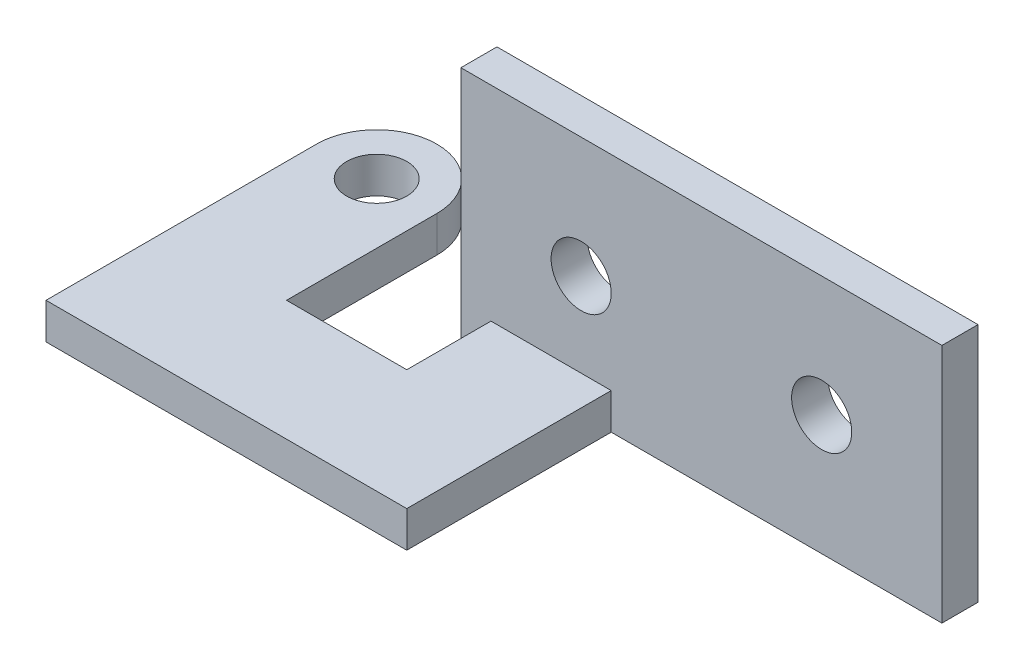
ISO-10303-21;
HEADER;
FILE_DESCRIPTION(('STEP AP214'),'2;1');
FILE_NAME('part.step','',(''),(''),'','','');
FILE_SCHEMA(('AUTOMOTIVE_DESIGN { 1 0 10303 214 1 1 1 1 }'));
ENDSEC;
DATA;
#1=APPLICATION_CONTEXT('core data for automotive mechanical design processes');
#2=APPLICATION_PROTOCOL_DEFINITION('international standard','automotive_design',2000,#1);
#3=PRODUCT_CONTEXT('',#1,'mechanical');
#4=PRODUCT('Part','Part','',(#3));
#5=PRODUCT_RELATED_PRODUCT_CATEGORY('part','',(#4));
#6=PRODUCT_DEFINITION_FORMATION('','',#4);
#7=PRODUCT_DEFINITION_CONTEXT('part definition',#1,'design');
#8=PRODUCT_DEFINITION('design','',#6,#7);
#9=PRODUCT_DEFINITION_SHAPE('','',#8);
#10=(LENGTH_UNIT() NAMED_UNIT(*) SI_UNIT(.MILLI.,.METRE.));
#11=(NAMED_UNIT(*) PLANE_ANGLE_UNIT() SI_UNIT($,.RADIAN.));
#12=(NAMED_UNIT(*) SI_UNIT($,.STERADIAN.) SOLID_ANGLE_UNIT());
#13=UNCERTAINTY_MEASURE_WITH_UNIT(LENGTH_MEASURE(1.E-05),#10,'distance_accuracy_value','');
#14=(GEOMETRIC_REPRESENTATION_CONTEXT(3) GLOBAL_UNCERTAINTY_ASSIGNED_CONTEXT((#13)) GLOBAL_UNIT_ASSIGNED_CONTEXT((#10,
#11,#12)) REPRESENTATION_CONTEXT('',''));
#15=CARTESIAN_POINT('',(0.,0.,0.));
#16=DIRECTION('',(0.,0.,1.));
#17=DIRECTION('',(1.,0.,0.));
#18=AXIS2_PLACEMENT_3D('',#15,#16,#17);
#19=CARTESIAN_POINT('',(0.,20.,3.));
#20=DIRECTION('',(0.,0.,-1.));
#21=DIRECTION('',(-1.,0.,0.));
#22=AXIS2_PLACEMENT_3D('',#19,#20,#21);
#23=PLANE('',#22);
#24=CARTESIAN_POINT('',(10.,10.,3.));
#25=DIRECTION('',(0.,0.,1.));
#26=DIRECTION('',(1.,0.,0.));
#27=AXIS2_PLACEMENT_3D('',#24,#25,#26);
#28=CIRCLE('',#27,2.5);
#29=CARTESIAN_POINT('',(12.5,10.,3.));
#30=VERTEX_POINT('',#29);
#31=EDGE_CURVE('E193',#30,#30,#28,.T.);
#32=ORIENTED_EDGE('',*,*,#31,.F.);
#33=EDGE_LOOP('',(#32));
#34=FACE_BOUND('',#33,.T.);
#35=DIRECTION('',(1.,0.,0.));
#36=VECTOR('',#35,1.);
#37=CARTESIAN_POINT('',(0.,3.,3.));
#38=LINE('',#37,#36);
#39=CARTESIAN_POINT('',(2.5000000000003,3.,3.));
#40=VERTEX_POINT('',#39);
#41=CARTESIAN_POINT('',(12.5000000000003,3.,3.));
#42=VERTEX_POINT('',#41);
#43=EDGE_CURVE('E184',#40,#42,#38,.T.);
#44=ORIENTED_EDGE('',*,*,#43,.T.);
#45=DIRECTION('',(0.,-1.,0.));
#46=VECTOR('',#45,1.);
#47=CARTESIAN_POINT('',(12.5000000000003,20.,3.));
#48=LINE('',#47,#46);
#49=CARTESIAN_POINT('',(12.5000000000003,0.,3.));
#50=VERTEX_POINT('',#49);
#51=EDGE_CURVE('E181',#42,#50,#48,.T.);
#52=ORIENTED_EDGE('',*,*,#51,.T.);
#53=DIRECTION('',(1.,0.,0.));
#54=VECTOR('',#53,1.);
#55=CARTESIAN_POINT('',(0.,0.,3.));
#56=LINE('',#55,#54);
#57=CARTESIAN_POINT('',(40.,0.,3.));
#58=VERTEX_POINT('',#57);
#59=EDGE_CURVE('E202',#50,#58,#56,.T.);
#60=ORIENTED_EDGE('',*,*,#59,.T.);
#61=DIRECTION('',(0.,1.,0.));
#62=VECTOR('',#61,1.);
#63=CARTESIAN_POINT('',(40.,0.,3.));
#64=LINE('',#63,#62);
#65=CARTESIAN_POINT('',(40.,20.,3.));
#66=VERTEX_POINT('',#65);
#67=EDGE_CURVE('E206',#58,#66,#64,.T.);
#68=ORIENTED_EDGE('',*,*,#67,.T.);
#69=DIRECTION('',(-1.,0.,0.));
#70=VECTOR('',#69,1.);
#71=CARTESIAN_POINT('',(0.,20.,3.));
#72=LINE('',#71,#70);
#73=CARTESIAN_POINT('',(0.,20.,3.));
#74=VERTEX_POINT('',#73);
#75=EDGE_CURVE('E208',#66,#74,#72,.T.);
#76=ORIENTED_EDGE('',*,*,#75,.T.);
#77=DIRECTION('',(0.,-1.,0.));
#78=VECTOR('',#77,1.);
#79=CARTESIAN_POINT('',(0.,0.,3.));
#80=LINE('',#79,#78);
#81=CARTESIAN_POINT('',(0.,0.,3.));
#82=VERTEX_POINT('',#81);
#83=EDGE_CURVE('E199',#74,#82,#80,.T.);
#84=ORIENTED_EDGE('',*,*,#83,.T.);
#85=CARTESIAN_POINT('',(2.5000000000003,0.,3.));
#86=VERTEX_POINT('',#85);
#87=EDGE_CURVE('E204',#82,#86,#56,.T.);
#88=ORIENTED_EDGE('',*,*,#87,.T.);
#89=DIRECTION('',(0.,1.,0.));
#90=VECTOR('',#89,1.);
#91=CARTESIAN_POINT('',(2.5000000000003,20.,3.));
#92=LINE('',#91,#90);
#93=EDGE_CURVE('E175',#86,#40,#92,.T.);
#94=ORIENTED_EDGE('',*,*,#93,.T.);
#95=EDGE_LOOP('',(#44,#52,#60,#68,#76,#84,#88,#94));
#96=FACE_BOUND('',#95,.T.);
#97=CARTESIAN_POINT('',(30.,10.,3.));
#98=DIRECTION('',(0.,0.,1.));
#99=DIRECTION('',(1.,0.,0.));
#100=AXIS2_PLACEMENT_3D('',#97,#98,#99);
#101=CIRCLE('',#100,2.5);
#102=CARTESIAN_POINT('',(32.5,10.,3.));
#103=VERTEX_POINT('',#102);
#104=EDGE_CURVE('E187',#103,#103,#101,.T.);
#105=ORIENTED_EDGE('',*,*,#104,.F.);
#106=EDGE_LOOP('',(#105));
#107=FACE_BOUND('',#106,.T.);
#108=ADVANCED_FACE('F31',(#34,#96,#107),#23,.F.);
#109=CARTESIAN_POINT('',(0.,20.,0.));
#110=DIRECTION('',(0.,0.,-1.));
#111=DIRECTION('',(-1.,0.,0.));
#112=AXIS2_PLACEMENT_3D('',#109,#110,#111);
#113=PLANE('',#112);
#114=DIRECTION('',(0.,1.,0.));
#115=VECTOR('',#114,1.);
#116=CARTESIAN_POINT('',(40.,0.,0.));
#117=LINE('',#116,#115);
#118=CARTESIAN_POINT('',(40.,0.,0.));
#119=VERTEX_POINT('',#118);
#120=CARTESIAN_POINT('',(40.,20.,0.));
#121=VERTEX_POINT('',#120);
#122=EDGE_CURVE('E215',#119,#121,#117,.T.);
#123=ORIENTED_EDGE('',*,*,#122,.F.);
#124=DIRECTION('',(1.,0.,0.));
#125=VECTOR('',#124,1.);
#126=CARTESIAN_POINT('',(0.,0.,0.));
#127=LINE('',#126,#125);
#128=CARTESIAN_POINT('',(0.,0.,0.));
#129=VERTEX_POINT('',#128);
#130=EDGE_CURVE('E213',#129,#119,#127,.T.);
#131=ORIENTED_EDGE('',*,*,#130,.F.);
#132=DIRECTION('',(0.,-1.,0.));
#133=VECTOR('',#132,1.);
#134=CARTESIAN_POINT('',(0.,0.,0.));
#135=LINE('',#134,#133);
#136=CARTESIAN_POINT('',(0.,20.,0.));
#137=VERTEX_POINT('',#136);
#138=EDGE_CURVE('E196',#137,#129,#135,.T.);
#139=ORIENTED_EDGE('',*,*,#138,.F.);
#140=DIRECTION('',(-1.,0.,0.));
#141=VECTOR('',#140,1.);
#142=CARTESIAN_POINT('',(0.,20.,0.));
#143=LINE('',#142,#141);
#144=EDGE_CURVE('E203',#121,#137,#143,.T.);
#145=ORIENTED_EDGE('',*,*,#144,.F.);
#146=EDGE_LOOP('',(#123,#131,#139,#145));
#147=FACE_BOUND('',#146,.T.);
#148=CARTESIAN_POINT('',(10.,10.,0.));
#149=DIRECTION('',(0.,0.,1.));
#150=DIRECTION('',(1.,0.,0.));
#151=AXIS2_PLACEMENT_3D('',#148,#149,#150);
#152=CIRCLE('',#151,2.5);
#153=CARTESIAN_POINT('',(12.5,10.,0.));
#154=VERTEX_POINT('',#153);
#155=EDGE_CURVE('E190',#154,#154,#152,.T.);
#156=ORIENTED_EDGE('',*,*,#155,.T.);
#157=EDGE_LOOP('',(#156));
#158=FACE_BOUND('',#157,.T.);
#159=CARTESIAN_POINT('',(30.,10.,0.));
#160=DIRECTION('',(0.,0.,1.));
#161=DIRECTION('',(1.,0.,0.));
#162=AXIS2_PLACEMENT_3D('',#159,#160,#161);
#163=CIRCLE('',#162,2.5);
#164=CARTESIAN_POINT('',(32.5,10.,0.));
#165=VERTEX_POINT('',#164);
#166=EDGE_CURVE('E186',#165,#165,#163,.T.);
#167=ORIENTED_EDGE('',*,*,#166,.T.);
#168=EDGE_LOOP('',(#167));
#169=FACE_BOUND('',#168,.T.);
#170=ADVANCED_FACE('F265',(#147,#158,#169),#113,.T.);
#171=CARTESIAN_POINT('',(0.,0.,3.));
#172=DIRECTION('',(1.,0.,0.));
#173=DIRECTION('',(0.,0.,-1.));
#174=AXIS2_PLACEMENT_3D('',#171,#172,#173);
#175=PLANE('',#174);
#176=ORIENTED_EDGE('',*,*,#138,.T.);
#177=DIRECTION('',(0.,0.,-1.));
#178=VECTOR('',#177,1.);
#179=CARTESIAN_POINT('',(0.,0.,3.));
#180=LINE('',#179,#178);
#181=EDGE_CURVE('E226',#82,#129,#180,.T.);
#182=ORIENTED_EDGE('',*,*,#181,.F.);
#183=ORIENTED_EDGE('',*,*,#83,.F.);
#184=DIRECTION('',(0.,0.,-1.));
#185=VECTOR('',#184,1.);
#186=CARTESIAN_POINT('',(0.,20.,3.));
#187=LINE('',#186,#185);
#188=EDGE_CURVE('E210',#74,#137,#187,.T.);
#189=ORIENTED_EDGE('',*,*,#188,.T.);
#190=EDGE_LOOP('',(#176,#182,#183,#189));
#191=FACE_BOUND('',#190,.T.);
#192=ADVANCED_FACE('F272',(#191),#175,.F.);
#193=CARTESIAN_POINT('',(0.,0.,3.));
#194=DIRECTION('',(0.,1.,0.));
#195=DIRECTION('',(0.,0.,1.));
#196=AXIS2_PLACEMENT_3D('',#193,#194,#195);
#197=PLANE('',#196);
#198=CARTESIAN_POINT('',(-12.4999999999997,0.,-2.5));
#199=DIRECTION('',(0.,1.,0.));
#200=DIRECTION('',(0.,0.,1.));
#201=AXIS2_PLACEMENT_3D('',#198,#199,#200);
#202=CIRCLE('',#201,5.);
#203=CARTESIAN_POINT('',(-17.4999999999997,0.,-2.5));
#204=VERTEX_POINT('',#203);
#205=CARTESIAN_POINT('',(-12.4999999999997,0.,-7.5));
#206=VERTEX_POINT('',#205);
#207=EDGE_CURVE('E229',#204,#206,#202,.F.);
#208=ORIENTED_EDGE('',*,*,#207,.T.);
#209=CARTESIAN_POINT('',(-12.4999999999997,0.,-2.5));
#210=DIRECTION('',(0.,1.,0.));
#211=DIRECTION('',(0.,0.,1.));
#212=AXIS2_PLACEMENT_3D('',#209,#210,#211);
#213=CIRCLE('',#212,5.);
#214=CARTESIAN_POINT('',(-7.4999999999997,0.,-2.5));
#215=VERTEX_POINT('',#214);
#216=EDGE_CURVE('E231',#206,#215,#213,.F.);
#217=ORIENTED_EDGE('',*,*,#216,.T.);
#218=DIRECTION('',(0.,0.,1.));
#219=VECTOR('',#218,1.);
#220=CARTESIAN_POINT('',(-7.49999999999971,0.,10.));
#221=LINE('',#220,#219);
#222=CARTESIAN_POINT('',(-7.49999999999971,0.,10.));
#223=VERTEX_POINT('',#222);
#224=EDGE_CURVE('E159',#215,#223,#221,.T.);
#225=ORIENTED_EDGE('',*,*,#224,.T.);
#226=DIRECTION('',(1.,0.,0.));
#227=VECTOR('',#226,1.);
#228=CARTESIAN_POINT('',(2.5000000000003,0.,10.));
#229=LINE('',#228,#227);
#230=CARTESIAN_POINT('',(2.5000000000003,0.,10.));
#231=VERTEX_POINT('',#230);
#232=EDGE_CURVE('E140',#223,#231,#229,.T.);
#233=ORIENTED_EDGE('',*,*,#232,.T.);
#234=DIRECTION('',(0.,0.,-1.));
#235=VECTOR('',#234,1.);
#236=CARTESIAN_POINT('',(2.5000000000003,0.,0.));
#237=LINE('',#236,#235);
#238=EDGE_CURVE('E163',#231,#86,#237,.T.);
#239=ORIENTED_EDGE('',*,*,#238,.T.);
#240=ORIENTED_EDGE('',*,*,#87,.F.);
#241=ORIENTED_EDGE('',*,*,#181,.T.);
#242=ORIENTED_EDGE('',*,*,#130,.T.);
#243=DIRECTION('',(0.,0.,-1.));
#244=VECTOR('',#243,1.);
#245=CARTESIAN_POINT('',(40.,0.,3.));
#246=LINE('',#245,#244);
#247=EDGE_CURVE('E223',#58,#119,#246,.T.);
#248=ORIENTED_EDGE('',*,*,#247,.F.);
#249=ORIENTED_EDGE('',*,*,#59,.F.);
#250=DIRECTION('',(0.,0.,1.));
#251=VECTOR('',#250,1.);
#252=CARTESIAN_POINT('',(12.5000000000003,0.,20.));
#253=LINE('',#252,#251);
#254=CARTESIAN_POINT('',(12.5000000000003,0.,20.));
#255=VERTEX_POINT('',#254);
#256=EDGE_CURVE('E166',#50,#255,#253,.T.);
#257=ORIENTED_EDGE('',*,*,#256,.T.);
#258=DIRECTION('',(-1.,0.,0.));
#259=VECTOR('',#258,1.);
#260=CARTESIAN_POINT('',(-17.4999999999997,0.,20.));
#261=LINE('',#260,#259);
#262=CARTESIAN_POINT('',(-17.4999999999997,0.,20.));
#263=VERTEX_POINT('',#262);
#264=EDGE_CURVE('E168',#255,#263,#261,.T.);
#265=ORIENTED_EDGE('',*,*,#264,.T.);
#266=DIRECTION('',(0.,0.,-1.));
#267=VECTOR('',#266,1.);
#268=CARTESIAN_POINT('',(-17.4999999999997,0.,-7.5));
#269=LINE('',#268,#267);
#270=EDGE_CURVE('E134',#263,#204,#269,.T.);
#271=ORIENTED_EDGE('',*,*,#270,.T.);
#272=EDGE_LOOP('',(#208,#217,#225,#233,#239,#240,#241,#242,#248,#249,#257,#265,#271));
#273=FACE_BOUND('',#272,.T.);
#274=CARTESIAN_POINT('',(-12.4999999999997,0.,-2.5));
#275=DIRECTION('',(0.,-1.,0.));
#276=DIRECTION('',(0.,0.,-1.));
#277=AXIS2_PLACEMENT_3D('',#274,#275,#276);
#278=CIRCLE('',#277,2.5);
#279=CARTESIAN_POINT('',(-12.4999999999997,0.,-5.));
#280=VERTEX_POINT('',#279);
#281=EDGE_CURVE('E245',#280,#280,#278,.T.);
#282=ORIENTED_EDGE('',*,*,#281,.F.);
#283=EDGE_LOOP('',(#282));
#284=FACE_BOUND('',#283,.T.);
#285=ADVANCED_FACE('F237',(#273,#284),#197,.F.);
#286=CARTESIAN_POINT('',(40.,0.,3.));
#287=DIRECTION('',(-1.,0.,0.));
#288=DIRECTION('',(0.,0.,1.));
#289=AXIS2_PLACEMENT_3D('',#286,#287,#288);
#290=PLANE('',#289);
#291=ORIENTED_EDGE('',*,*,#122,.T.);
#292=DIRECTION('',(0.,0.,-1.));
#293=VECTOR('',#292,1.);
#294=CARTESIAN_POINT('',(40.,20.,3.));
#295=LINE('',#294,#293);
#296=EDGE_CURVE('E220',#66,#121,#295,.T.);
#297=ORIENTED_EDGE('',*,*,#296,.F.);
#298=ORIENTED_EDGE('',*,*,#67,.F.);
#299=ORIENTED_EDGE('',*,*,#247,.T.);
#300=EDGE_LOOP('',(#291,#297,#298,#299));
#301=FACE_BOUND('',#300,.T.);
#302=ADVANCED_FACE('F284',(#301),#290,.F.);
#303=CARTESIAN_POINT('',(0.,20.,3.));
#304=DIRECTION('',(0.,-1.,0.));
#305=DIRECTION('',(0.,0.,-1.));
#306=AXIS2_PLACEMENT_3D('',#303,#304,#305);
#307=PLANE('',#306);
#308=ORIENTED_EDGE('',*,*,#144,.T.);
#309=ORIENTED_EDGE('',*,*,#188,.F.);
#310=ORIENTED_EDGE('',*,*,#75,.F.);
#311=ORIENTED_EDGE('',*,*,#296,.T.);
#312=EDGE_LOOP('',(#308,#309,#310,#311));
#313=FACE_BOUND('',#312,.T.);
#314=ADVANCED_FACE('F281',(#313),#307,.F.);
#315=CARTESIAN_POINT('',(10.,10.,3.));
#316=DIRECTION('',(0.,0.,-1.));
#317=DIRECTION('',(-1.,0.,0.));
#318=AXIS2_PLACEMENT_3D('',#315,#316,#317);
#319=CYLINDRICAL_SURFACE('',#318,2.5);
#320=ORIENTED_EDGE('',*,*,#31,.T.);
#321=EDGE_LOOP('',(#320));
#322=FACE_BOUND('',#321,.T.);
#323=ORIENTED_EDGE('',*,*,#155,.F.);
#324=EDGE_LOOP('',(#323));
#325=FACE_BOUND('',#324,.T.);
#326=ADVANCED_FACE('F278',(#322,#325),#319,.F.);
#327=CARTESIAN_POINT('',(30.,10.,3.));
#328=DIRECTION('',(0.,0.,-1.));
#329=DIRECTION('',(-1.,0.,0.));
#330=AXIS2_PLACEMENT_3D('',#327,#328,#329);
#331=CYLINDRICAL_SURFACE('',#330,2.5);
#332=ORIENTED_EDGE('',*,*,#104,.T.);
#333=EDGE_LOOP('',(#332));
#334=FACE_BOUND('',#333,.T.);
#335=ORIENTED_EDGE('',*,*,#166,.F.);
#336=EDGE_LOOP('',(#335));
#337=FACE_BOUND('',#336,.T.);
#338=ADVANCED_FACE('F334',(#334,#337),#331,.F.);
#339=CARTESIAN_POINT('',(-7.4999999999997,3.,-7.5));
#340=DIRECTION('',(0.,1.,0.));
#341=DIRECTION('',(0.,0.,1.));
#342=AXIS2_PLACEMENT_3D('',#339,#340,#341);
#343=PLANE('',#342);
#344=CARTESIAN_POINT('',(-12.4999999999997,3.,-2.5));
#345=DIRECTION('',(0.,-1.,0.));
#346=DIRECTION('',(0.,0.,-1.));
#347=AXIS2_PLACEMENT_3D('',#344,#345,#346);
#348=CIRCLE('',#347,2.5);
#349=CARTESIAN_POINT('',(-12.4999999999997,3.,-5.));
#350=VERTEX_POINT('',#349);
#351=EDGE_CURVE('E161',#350,#350,#348,.T.);
#352=ORIENTED_EDGE('',*,*,#351,.T.);
#353=EDGE_LOOP('',(#352));
#354=FACE_BOUND('',#353,.T.);
#355=DIRECTION('',(0.,0.,1.));
#356=VECTOR('',#355,1.);
#357=CARTESIAN_POINT('',(-7.49999999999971,3.,10.));
#358=LINE('',#357,#356);
#359=CARTESIAN_POINT('',(-7.4999999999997,3.,-2.5));
#360=VERTEX_POINT('',#359);
#361=CARTESIAN_POINT('',(-7.49999999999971,3.,10.));
#362=VERTEX_POINT('',#361);
#363=EDGE_CURVE('E124',#360,#362,#358,.T.);
#364=ORIENTED_EDGE('',*,*,#363,.F.);
#365=CARTESIAN_POINT('',(-12.4999999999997,3.,-2.5));
#366=DIRECTION('',(0.,1.,0.));
#367=DIRECTION('',(0.,0.,1.));
#368=AXIS2_PLACEMENT_3D('',#365,#366,#367);
#369=CIRCLE('',#368,5.);
#370=CARTESIAN_POINT('',(-12.4999999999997,3.,-7.5));
#371=VERTEX_POINT('',#370);
#372=EDGE_CURVE('E40',#360,#371,#369,.T.);
#373=ORIENTED_EDGE('',*,*,#372,.T.);
#374=CARTESIAN_POINT('',(-12.4999999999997,3.,-2.5));
#375=DIRECTION('',(0.,1.,0.));
#376=DIRECTION('',(0.,0.,1.));
#377=AXIS2_PLACEMENT_3D('',#374,#375,#376);
#378=CIRCLE('',#377,5.);
#379=CARTESIAN_POINT('',(-17.4999999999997,3.,-2.5));
#380=VERTEX_POINT('',#379);
#381=EDGE_CURVE('E47',#371,#380,#378,.T.);
#382=ORIENTED_EDGE('',*,*,#381,.T.);
#383=DIRECTION('',(0.,0.,-1.));
#384=VECTOR('',#383,1.);
#385=CARTESIAN_POINT('',(-17.4999999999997,3.,-7.5));
#386=LINE('',#385,#384);
#387=CARTESIAN_POINT('',(-17.4999999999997,3.,20.));
#388=VERTEX_POINT('',#387);
#389=EDGE_CURVE('E142',#388,#380,#386,.T.);
#390=ORIENTED_EDGE('',*,*,#389,.F.);
#391=DIRECTION('',(-1.,0.,0.));
#392=VECTOR('',#391,1.);
#393=CARTESIAN_POINT('',(-17.4999999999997,3.,20.));
#394=LINE('',#393,#392);
#395=CARTESIAN_POINT('',(12.5000000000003,3.,20.));
#396=VERTEX_POINT('',#395);
#397=EDGE_CURVE('E155',#396,#388,#394,.T.);
#398=ORIENTED_EDGE('',*,*,#397,.F.);
#399=DIRECTION('',(0.,0.,1.));
#400=VECTOR('',#399,1.);
#401=CARTESIAN_POINT('',(12.5000000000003,3.,20.));
#402=LINE('',#401,#400);
#403=EDGE_CURVE('E150',#42,#396,#402,.T.);
#404=ORIENTED_EDGE('',*,*,#403,.F.);
#405=ORIENTED_EDGE('',*,*,#43,.F.);
#406=DIRECTION('',(0.,0.,-1.));
#407=VECTOR('',#406,1.);
#408=CARTESIAN_POINT('',(2.5000000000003,3.,0.));
#409=LINE('',#408,#407);
#410=CARTESIAN_POINT('',(2.5000000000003,3.,10.));
#411=VERTEX_POINT('',#410);
#412=EDGE_CURVE('E148',#411,#40,#409,.T.);
#413=ORIENTED_EDGE('',*,*,#412,.F.);
#414=DIRECTION('',(1.,0.,0.));
#415=VECTOR('',#414,1.);
#416=CARTESIAN_POINT('',(2.5000000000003,3.,10.));
#417=LINE('',#416,#415);
#418=EDGE_CURVE('E133',#362,#411,#417,.T.);
#419=ORIENTED_EDGE('',*,*,#418,.F.);
#420=EDGE_LOOP('',(#364,#373,#382,#390,#398,#404,#405,#413,#419));
#421=FACE_BOUND('',#420,.T.);
#422=ADVANCED_FACE('F145',(#354,#421),#343,.T.);
#423=CARTESIAN_POINT('',(12.5000000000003,3.,20.));
#424=DIRECTION('',(1.,0.,0.));
#425=DIRECTION('',(0.,0.,-1.));
#426=AXIS2_PLACEMENT_3D('',#423,#424,#425);
#427=PLANE('',#426);
#428=ORIENTED_EDGE('',*,*,#51,.F.);
#429=ORIENTED_EDGE('',*,*,#403,.T.);
#430=DIRECTION('',(0.,-1.,0.));
#431=VECTOR('',#430,1.);
#432=CARTESIAN_POINT('',(12.5000000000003,3.,20.));
#433=LINE('',#432,#431);
#434=EDGE_CURVE('E176',#396,#255,#433,.T.);
#435=ORIENTED_EDGE('',*,*,#434,.T.);
#436=ORIENTED_EDGE('',*,*,#256,.F.);
#437=EDGE_LOOP('',(#428,#429,#435,#436));
#438=FACE_BOUND('',#437,.T.);
#439=ADVANCED_FACE('F333',(#438),#427,.T.);
#440=CARTESIAN_POINT('',(2.5000000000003,3.,0.));
#441=DIRECTION('',(-1.,0.,0.));
#442=DIRECTION('',(0.,0.,1.));
#443=AXIS2_PLACEMENT_3D('',#440,#441,#442);
#444=PLANE('',#443);
#445=ORIENTED_EDGE('',*,*,#93,.F.);
#446=ORIENTED_EDGE('',*,*,#238,.F.);
#447=DIRECTION('',(0.,-1.,0.));
#448=VECTOR('',#447,1.);
#449=CARTESIAN_POINT('',(2.5000000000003,3.,10.));
#450=LINE('',#449,#448);
#451=EDGE_CURVE('E141',#411,#231,#450,.T.);
#452=ORIENTED_EDGE('',*,*,#451,.F.);
#453=ORIENTED_EDGE('',*,*,#412,.T.);
#454=EDGE_LOOP('',(#445,#446,#452,#453));
#455=FACE_BOUND('',#454,.T.);
#456=ADVANCED_FACE('F322',(#455),#444,.T.);
#457=CARTESIAN_POINT('',(-7.49999999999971,3.,10.));
#458=DIRECTION('',(1.,0.,0.));
#459=DIRECTION('',(0.,0.,-1.));
#460=AXIS2_PLACEMENT_3D('',#457,#458,#459);
#461=PLANE('',#460);
#462=ORIENTED_EDGE('',*,*,#224,.F.);
#463=DIRECTION('',(0.,-1.,0.));
#464=VECTOR('',#463,1.);
#465=CARTESIAN_POINT('',(-7.4999999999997,3.,-2.5));
#466=LINE('',#465,#464);
#467=EDGE_CURVE('E131',#215,#360,#466,.F.);
#468=ORIENTED_EDGE('',*,*,#467,.T.);
#469=ORIENTED_EDGE('',*,*,#363,.T.);
#470=DIRECTION('',(0.,-1.,0.));
#471=VECTOR('',#470,1.);
#472=CARTESIAN_POINT('',(-7.49999999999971,3.,10.));
#473=LINE('',#472,#471);
#474=EDGE_CURVE('E128',#362,#223,#473,.T.);
#475=ORIENTED_EDGE('',*,*,#474,.T.);
#476=EDGE_LOOP('',(#462,#468,#469,#475));
#477=FACE_BOUND('',#476,.T.);
#478=ADVANCED_FACE('F127',(#477),#461,.T.);
#479=CARTESIAN_POINT('',(-17.4999999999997,3.,-7.5));
#480=DIRECTION('',(-1.,0.,0.));
#481=DIRECTION('',(0.,0.,1.));
#482=AXIS2_PLACEMENT_3D('',#479,#480,#481);
#483=PLANE('',#482);
#484=ORIENTED_EDGE('',*,*,#389,.T.);
#485=DIRECTION('',(0.,-1.,0.));
#486=VECTOR('',#485,1.);
#487=CARTESIAN_POINT('',(-17.4999999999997,3.,-2.5));
#488=LINE('',#487,#486);
#489=EDGE_CURVE('E11',#380,#204,#488,.T.);
#490=ORIENTED_EDGE('',*,*,#489,.T.);
#491=ORIENTED_EDGE('',*,*,#270,.F.);
#492=DIRECTION('',(0.,-1.,0.));
#493=VECTOR('',#492,1.);
#494=CARTESIAN_POINT('',(-17.4999999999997,3.,20.));
#495=LINE('',#494,#493);
#496=EDGE_CURVE('E173',#388,#263,#495,.T.);
#497=ORIENTED_EDGE('',*,*,#496,.F.);
#498=EDGE_LOOP('',(#484,#490,#491,#497));
#499=FACE_BOUND('',#498,.T.);
#500=ADVANCED_FACE('F306',(#499),#483,.T.);
#501=CARTESIAN_POINT('',(-17.4999999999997,3.,20.));
#502=DIRECTION('',(0.,0.,1.));
#503=DIRECTION('',(1.,0.,0.));
#504=AXIS2_PLACEMENT_3D('',#501,#502,#503);
#505=PLANE('',#504);
#506=ORIENTED_EDGE('',*,*,#264,.F.);
#507=ORIENTED_EDGE('',*,*,#434,.F.);
#508=ORIENTED_EDGE('',*,*,#397,.T.);
#509=ORIENTED_EDGE('',*,*,#496,.T.);
#510=EDGE_LOOP('',(#506,#507,#508,#509));
#511=FACE_BOUND('',#510,.T.);
#512=ADVANCED_FACE('F261',(#511),#505,.T.);
#513=CARTESIAN_POINT('',(2.5000000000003,3.,10.));
#514=DIRECTION('',(0.,0.,-1.));
#515=DIRECTION('',(-1.,0.,0.));
#516=AXIS2_PLACEMENT_3D('',#513,#514,#515);
#517=PLANE('',#516);
#518=ORIENTED_EDGE('',*,*,#232,.F.);
#519=ORIENTED_EDGE('',*,*,#474,.F.);
#520=ORIENTED_EDGE('',*,*,#418,.T.);
#521=ORIENTED_EDGE('',*,*,#451,.T.);
#522=EDGE_LOOP('',(#518,#519,#520,#521));
#523=FACE_BOUND('',#522,.T.);
#524=ADVANCED_FACE('F138',(#523),#517,.T.);
#525=CARTESIAN_POINT('',(-12.4999999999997,3.,-2.5));
#526=DIRECTION('',(0.,-1.,0.));
#527=DIRECTION('',(0.,0.,-1.));
#528=AXIS2_PLACEMENT_3D('',#525,#526,#527);
#529=CYLINDRICAL_SURFACE('',#528,2.5);
#530=ORIENTED_EDGE('',*,*,#351,.F.);
#531=EDGE_LOOP('',(#530));
#532=FACE_BOUND('',#531,.T.);
#533=ORIENTED_EDGE('',*,*,#281,.T.);
#534=EDGE_LOOP('',(#533));
#535=FACE_BOUND('',#534,.T.);
#536=ADVANCED_FACE('F254',(#532,#535),#529,.F.);
#537=CARTESIAN_POINT('',(-12.4999999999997,3.,-2.5));
#538=DIRECTION('',(0.,-1.,0.));
#539=DIRECTION('',(0.,0.,-1.));
#540=AXIS2_PLACEMENT_3D('',#537,#538,#539);
#541=CYLINDRICAL_SURFACE('',#540,5.);
#542=ORIENTED_EDGE('',*,*,#489,.F.);
#543=ORIENTED_EDGE('',*,*,#381,.F.);
#544=DIRECTION('',(0.,-1.,0.));
#545=VECTOR('',#544,1.);
#546=CARTESIAN_POINT('',(-12.4999999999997,3.,-7.5));
#547=LINE('',#546,#545);
#548=EDGE_CURVE('E35',#206,#371,#547,.F.);
#549=ORIENTED_EDGE('',*,*,#548,.F.);
#550=ORIENTED_EDGE('',*,*,#207,.F.);
#551=EDGE_LOOP('',(#542,#543,#549,#550));
#552=FACE_BOUND('',#551,.T.);
#553=ADVANCED_FACE('F33',(#552),#541,.T.);
#554=CARTESIAN_POINT('',(-12.4999999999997,3.,-2.5));
#555=DIRECTION('',(0.,-1.,0.));
#556=DIRECTION('',(0.,0.,-1.));
#557=AXIS2_PLACEMENT_3D('',#554,#555,#556);
#558=CYLINDRICAL_SURFACE('',#557,5.);
#559=ORIENTED_EDGE('',*,*,#372,.F.);
#560=ORIENTED_EDGE('',*,*,#467,.F.);
#561=ORIENTED_EDGE('',*,*,#216,.F.);
#562=ORIENTED_EDGE('',*,*,#548,.T.);
#563=EDGE_LOOP('',(#559,#560,#561,#562));
#564=FACE_BOUND('',#563,.T.);
#565=ADVANCED_FACE('F243',(#564),#558,.T.);
#566=CLOSED_SHELL('',(#108,#170,#192,#285,#302,#314,#326,#338,#422,#439,#456,#478,#500,#512,
#524,#536,#553,#565));
#567=MANIFOLD_SOLID_BREP('B2',#566);
#568=ADVANCED_BREP_SHAPE_REPRESENTATION('',(#18,#567),#14);
#569=SHAPE_DEFINITION_REPRESENTATION(#9,#568);
ENDSEC;
END-ISO-10303-21;
